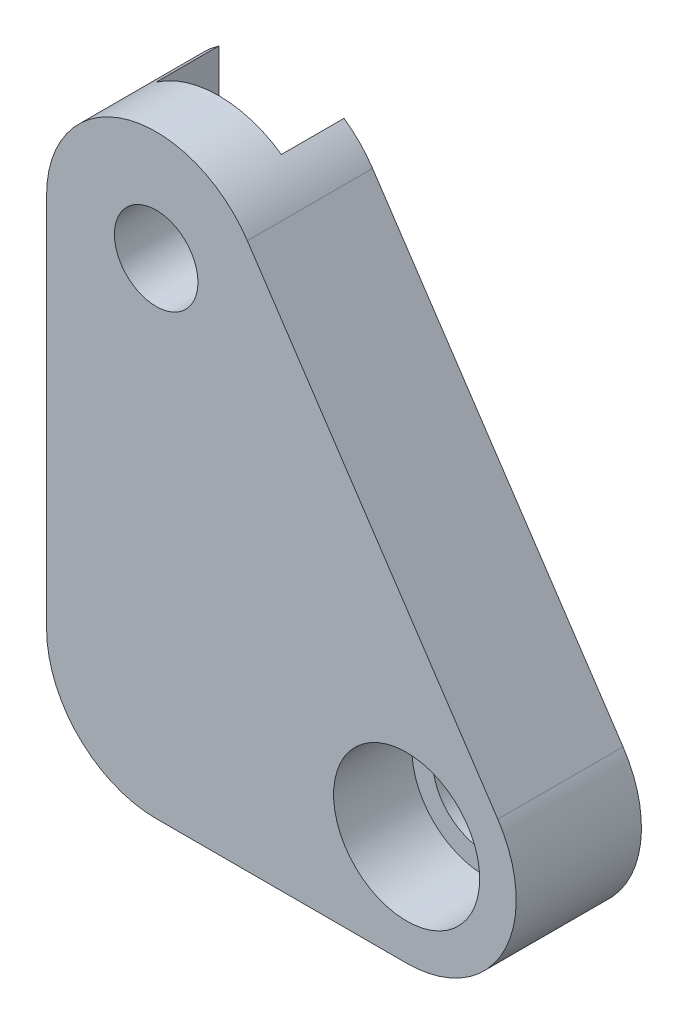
ISO-10303-21;
HEADER;
FILE_DESCRIPTION(('STEP AP214'),'2;1');
FILE_NAME('part.step','',(''),(''),'','','');
FILE_SCHEMA(('AUTOMOTIVE_DESIGN { 1 0 10303 214 1 1 1 1 }'));
ENDSEC;
DATA;
#1=APPLICATION_CONTEXT('core data for automotive mechanical design processes');
#2=APPLICATION_PROTOCOL_DEFINITION('international standard','automotive_design',2000,#1);
#3=PRODUCT_CONTEXT('',#1,'mechanical');
#4=PRODUCT('Part','Part','',(#3));
#5=PRODUCT_RELATED_PRODUCT_CATEGORY('part','',(#4));
#6=PRODUCT_DEFINITION_FORMATION('','',#4);
#7=PRODUCT_DEFINITION_CONTEXT('part definition',#1,'design');
#8=PRODUCT_DEFINITION('design','',#6,#7);
#9=PRODUCT_DEFINITION_SHAPE('','',#8);
#10=(LENGTH_UNIT() NAMED_UNIT(*) SI_UNIT(.MILLI.,.METRE.));
#11=(NAMED_UNIT(*) PLANE_ANGLE_UNIT() SI_UNIT($,.RADIAN.));
#12=(NAMED_UNIT(*) SI_UNIT($,.STERADIAN.) SOLID_ANGLE_UNIT());
#13=UNCERTAINTY_MEASURE_WITH_UNIT(LENGTH_MEASURE(1.E-05),#10,'distance_accuracy_value','');
#14=(GEOMETRIC_REPRESENTATION_CONTEXT(3) GLOBAL_UNCERTAINTY_ASSIGNED_CONTEXT((#13)) GLOBAL_UNIT_ASSIGNED_CONTEXT((#10,
#11,#12)) REPRESENTATION_CONTEXT('',''));
#15=CARTESIAN_POINT('',(0.,0.,0.));
#16=DIRECTION('',(0.,0.,1.));
#17=DIRECTION('',(1.,0.,0.));
#18=AXIS2_PLACEMENT_3D('',#15,#16,#17);
#19=CARTESIAN_POINT('',(1.94995117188,93.0009999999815,18.));
#20=DIRECTION('',(0.,0.,1.));
#21=DIRECTION('',(1.,0.,0.));
#22=AXIS2_PLACEMENT_3D('',#19,#20,#21);
#23=PLANE('',#22);
#24=DIRECTION('',(-1.,0.,0.));
#25=VECTOR('',#24,1.);
#26=CARTESIAN_POINT('',(1.94995117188,-21.,18.));
#27=LINE('',#26,#25);
#28=CARTESIAN_POINT('',(1.94995117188,-21.,18.));
#29=VERTEX_POINT('',#28);
#30=CARTESIAN_POINT('',(-10.0500488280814,-21.,18.));
#31=VERTEX_POINT('',#30);
#32=EDGE_CURVE('E121',#29,#31,#27,.T.);
#33=ORIENTED_EDGE('',*,*,#32,.T.);
#34=CARTESIAN_POINT('',(-10.0500488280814,1.70835567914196E-11,18.));
#35=DIRECTION('',(0.,0.,1.));
#36=DIRECTION('',(1.,0.,0.));
#37=AXIS2_PLACEMENT_3D('',#34,#35,#36);
#38=CIRCLE('',#37,21.);
#39=CARTESIAN_POINT('',(-22.0500488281,-17.2336879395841,18.));
#40=VERTEX_POINT('',#39);
#41=EDGE_CURVE('E173',#31,#40,#38,.F.);
#42=ORIENTED_EDGE('',*,*,#41,.T.);
#43=DIRECTION('',(0.,-1.,0.));
#44=VECTOR('',#43,1.);
#45=CARTESIAN_POINT('',(-22.0500488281,93.0009999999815,18.));
#46=LINE('',#45,#44);
#47=CARTESIAN_POINT('',(-22.0500488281,89.2336879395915,18.));
#48=VERTEX_POINT('',#47);
#49=EDGE_CURVE('E179',#48,#40,#46,.T.);
#50=ORIENTED_EDGE('',*,*,#49,.F.);
#51=CARTESIAN_POINT('',(-10.0500488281,72.,18.));
#52=DIRECTION('',(0.,0.,1.));
#53=DIRECTION('',(1.,0.,0.));
#54=AXIS2_PLACEMENT_3D('',#51,#52,#53);
#55=CIRCLE('',#54,20.9999999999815);
#56=CARTESIAN_POINT('',(1.94995117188,89.2336879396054,18.));
#57=VERTEX_POINT('',#56);
#58=EDGE_CURVE('E130',#57,#48,#55,.T.);
#59=ORIENTED_EDGE('',*,*,#58,.F.);
#60=DIRECTION('',(0.,-1.,0.));
#61=VECTOR('',#60,1.);
#62=CARTESIAN_POINT('',(1.94995117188,93.0009999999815,18.));
#63=LINE('',#62,#61);
#64=EDGE_CURVE('E184',#57,#29,#63,.T.);
#65=ORIENTED_EDGE('',*,*,#64,.T.);
#66=EDGE_LOOP('',(#33,#42,#50,#59,#65));
#67=FACE_BOUND('',#66,.T.);
#68=CARTESIAN_POINT('',(-10.0500488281,72.,18.));
#69=DIRECTION('',(0.,0.,-1.));
#70=DIRECTION('',(-1.,0.,0.));
#71=AXIS2_PLACEMENT_3D('',#68,#69,#70);
#72=CIRCLE('',#71,7.99999999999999);
#73=CARTESIAN_POINT('',(-18.0500488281,72.,18.));
#74=VERTEX_POINT('',#73);
#75=EDGE_CURVE('E219',#74,#74,#72,.T.);
#76=ORIENTED_EDGE('',*,*,#75,.F.);
#77=EDGE_LOOP('',(#76));
#78=FACE_BOUND('',#77,.T.);
#79=ADVANCED_FACE('F37',(#67,#78),#23,.F.);
#80=CARTESIAN_POINT('',(-10.0500488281,72.,6.));
#81=DIRECTION('',(0.,0.,-1.));
#82=DIRECTION('',(-1.,0.,0.));
#83=AXIS2_PLACEMENT_3D('',#80,#81,#82);
#84=PLANE('',#83);
#85=DIRECTION('',(0.,-1.,0.));
#86=VECTOR('',#85,1.);
#87=CARTESIAN_POINT('',(-22.0500488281,93.0009999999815,6.));
#88=LINE('',#87,#86);
#89=CARTESIAN_POINT('',(-22.0500488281,89.2336879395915,6.));
#90=VERTEX_POINT('',#89);
#91=CARTESIAN_POINT('',(-22.0500488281,-17.2336879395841,6.));
#92=VERTEX_POINT('',#91);
#93=EDGE_CURVE('E111',#90,#92,#88,.T.);
#94=ORIENTED_EDGE('',*,*,#93,.T.);
#95=CARTESIAN_POINT('',(-10.0500488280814,1.70835567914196E-11,6.));
#96=DIRECTION('',(0.,0.,-1.));
#97=DIRECTION('',(-1.,0.,0.));
#98=AXIS2_PLACEMENT_3D('',#95,#96,#97);
#99=CIRCLE('',#98,21.);
#100=CARTESIAN_POINT('',(-31.0500488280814,1.70766178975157E-11,6.));
#101=VERTEX_POINT('',#100);
#102=EDGE_CURVE('E59',#92,#101,#99,.T.);
#103=ORIENTED_EDGE('',*,*,#102,.T.);
#104=DIRECTION('',(0.,1.,0.));
#105=VECTOR('',#104,1.);
#106=CARTESIAN_POINT('',(-31.0500488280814,-20.9999999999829,6.));
#107=LINE('',#106,#105);
#108=CARTESIAN_POINT('',(-31.0500488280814,72.,6.));
#109=VERTEX_POINT('',#108);
#110=EDGE_CURVE('E134',#101,#109,#107,.T.);
#111=ORIENTED_EDGE('',*,*,#110,.T.);
#112=CARTESIAN_POINT('',(-10.0500488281,72.,6.));
#113=DIRECTION('',(0.,0.,-1.));
#114=DIRECTION('',(-1.,0.,0.));
#115=AXIS2_PLACEMENT_3D('',#112,#113,#114);
#116=CIRCLE('',#115,20.9999999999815);
#117=EDGE_CURVE('E128',#109,#90,#116,.T.);
#118=ORIENTED_EDGE('',*,*,#117,.T.);
#119=EDGE_LOOP('',(#94,#103,#111,#118));
#120=FACE_BOUND('',#119,.T.);
#121=ADVANCED_FACE('F133',(#120),#84,.T.);
#122=CARTESIAN_POINT('',(37.9499511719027,-20.9999999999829,30.));
#123=DIRECTION('',(0.,-1.,0.));
#124=DIRECTION('',(0.,0.,-1.));
#125=AXIS2_PLACEMENT_3D('',#122,#123,#124);
#126=PLANE('',#125);
#127=DIRECTION('',(-1.,0.,0.));
#128=VECTOR('',#127,1.);
#129=CARTESIAN_POINT('',(37.9499511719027,-20.9999999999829,30.));
#130=LINE('',#129,#128);
#131=CARTESIAN_POINT('',(37.9499511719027,-20.9999999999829,30.));
#132=VERTEX_POINT('',#131);
#133=CARTESIAN_POINT('',(-10.0500488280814,-20.9999999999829,30.));
#134=VERTEX_POINT('',#133);
#135=EDGE_CURVE('E147',#132,#134,#130,.T.);
#136=ORIENTED_EDGE('',*,*,#135,.T.);
#137=DIRECTION('',(0.,0.,-1.));
#138=VECTOR('',#137,1.);
#139=CARTESIAN_POINT('',(-10.0500488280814,-20.9999999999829,30.));
#140=LINE('',#139,#138);
#141=EDGE_CURVE('E164',#134,#31,#140,.T.);
#142=ORIENTED_EDGE('',*,*,#141,.T.);
#143=ORIENTED_EDGE('',*,*,#32,.F.);
#144=DIRECTION('',(0.,0.,1.));
#145=VECTOR('',#144,1.);
#146=CARTESIAN_POINT('',(1.94995117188,-21.,6.));
#147=LINE('',#146,#145);
#148=CARTESIAN_POINT('',(1.94995117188,-21.,6.));
#149=VERTEX_POINT('',#148);
#150=EDGE_CURVE('E131',#149,#29,#147,.T.);
#151=ORIENTED_EDGE('',*,*,#150,.F.);
#152=DIRECTION('',(-1.,0.,0.));
#153=VECTOR('',#152,1.);
#154=CARTESIAN_POINT('',(37.9499511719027,-20.9999999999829,6.));
#155=LINE('',#154,#153);
#156=CARTESIAN_POINT('',(37.9499511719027,-20.9999999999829,6.));
#157=VERTEX_POINT('',#156);
#158=EDGE_CURVE('E183',#157,#149,#155,.T.);
#159=ORIENTED_EDGE('',*,*,#158,.F.);
#160=DIRECTION('',(0.,0.,-1.));
#161=VECTOR('',#160,1.);
#162=CARTESIAN_POINT('',(37.9499511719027,-20.9999999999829,30.));
#163=LINE('',#162,#161);
#164=EDGE_CURVE('E162',#132,#157,#163,.T.);
#165=ORIENTED_EDGE('',*,*,#164,.F.);
#166=EDGE_LOOP('',(#136,#142,#143,#151,#159,#165));
#167=FACE_BOUND('',#166,.T.);
#168=ADVANCED_FACE('F39',(#167),#126,.T.);
#169=CARTESIAN_POINT('',(37.9499511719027,1.81278603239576E-12,30.));
#170=DIRECTION('',(0.,0.,-1.));
#171=DIRECTION('',(-1.,0.,0.));
#172=AXIS2_PLACEMENT_3D('',#169,#170,#171);
#173=CYLINDRICAL_SURFACE('',#172,20.9999999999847);
#174=CARTESIAN_POINT('',(37.9499511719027,1.81278603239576E-12,6.));
#175=DIRECTION('',(0.,0.,-1.));
#176=DIRECTION('',(-1.,0.,0.));
#177=AXIS2_PLACEMENT_3D('',#174,#175,#176);
#178=CIRCLE('',#177,20.9999999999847);
#179=CARTESIAN_POINT('',(55.4230073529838,11.6487041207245,6.));
#180=VERTEX_POINT('',#179);
#181=EDGE_CURVE('E140',#180,#157,#178,.T.);
#182=ORIENTED_EDGE('',*,*,#181,.F.);
#183=DIRECTION('',(0.,0.,-1.));
#184=VECTOR('',#183,1.);
#185=CARTESIAN_POINT('',(55.4230073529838,11.6487041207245,30.));
#186=LINE('',#185,#184);
#187=CARTESIAN_POINT('',(55.4230073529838,11.6487041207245,30.));
#188=VERTEX_POINT('',#187);
#189=EDGE_CURVE('E165',#188,#180,#186,.T.);
#190=ORIENTED_EDGE('',*,*,#189,.F.);
#191=CARTESIAN_POINT('',(37.9499511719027,1.81278603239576E-12,30.));
#192=DIRECTION('',(0.,0.,-1.));
#193=DIRECTION('',(-1.,0.,0.));
#194=AXIS2_PLACEMENT_3D('',#191,#192,#193);
#195=CIRCLE('',#194,20.9999999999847);
#196=EDGE_CURVE('E158',#188,#132,#195,.T.);
#197=ORIENTED_EDGE('',*,*,#196,.T.);
#198=ORIENTED_EDGE('',*,*,#164,.T.);
#199=EDGE_LOOP('',(#182,#190,#197,#198));
#200=FACE_BOUND('',#199,.T.);
#201=ADVANCED_FACE('F199',(#200),#173,.T.);
#202=CARTESIAN_POINT('',(7.4230073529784,83.6487041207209,30.));
#203=DIRECTION('',(0.832050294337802,0.554700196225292,0.));
#204=DIRECTION('',(-0.554700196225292,0.832050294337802,0.));
#205=AXIS2_PLACEMENT_3D('',#202,#203,#204);
#206=PLANE('',#205);
#207=DIRECTION('',(0.554700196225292,-0.832050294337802,0.));
#208=VECTOR('',#207,1.);
#209=CARTESIAN_POINT('',(7.4230073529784,83.6487041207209,6.));
#210=LINE('',#209,#208);
#211=CARTESIAN_POINT('',(7.4230073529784,83.6487041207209,6.));
#212=VERTEX_POINT('',#211);
#213=EDGE_CURVE('E136',#212,#180,#210,.T.);
#214=ORIENTED_EDGE('',*,*,#213,.F.);
#215=DIRECTION('',(0.,0.,-1.));
#216=VECTOR('',#215,1.);
#217=CARTESIAN_POINT('',(7.4230073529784,83.6487041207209,30.));
#218=LINE('',#217,#216);
#219=CARTESIAN_POINT('',(7.4230073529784,83.6487041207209,30.));
#220=VERTEX_POINT('',#219);
#221=EDGE_CURVE('E167',#220,#212,#218,.T.);
#222=ORIENTED_EDGE('',*,*,#221,.F.);
#223=DIRECTION('',(0.554700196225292,-0.832050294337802,0.));
#224=VECTOR('',#223,1.);
#225=CARTESIAN_POINT('',(7.4230073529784,83.6487041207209,30.));
#226=LINE('',#225,#224);
#227=EDGE_CURVE('E155',#220,#188,#226,.T.);
#228=ORIENTED_EDGE('',*,*,#227,.T.);
#229=ORIENTED_EDGE('',*,*,#189,.T.);
#230=EDGE_LOOP('',(#214,#222,#228,#229));
#231=FACE_BOUND('',#230,.T.);
#232=ADVANCED_FACE('F267',(#231),#206,.T.);
#233=CARTESIAN_POINT('',(-10.0500488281,72.,30.));
#234=DIRECTION('',(0.,0.,-1.));
#235=DIRECTION('',(-1.,0.,0.));
#236=AXIS2_PLACEMENT_3D('',#233,#234,#235);
#237=CYLINDRICAL_SURFACE('',#236,20.9999999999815);
#238=DIRECTION('',(0.,0.,-1.));
#239=VECTOR('',#238,1.);
#240=CARTESIAN_POINT('',(-22.0500488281,89.2336879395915,30.));
#241=LINE('',#240,#239);
#242=EDGE_CURVE('E115',#48,#90,#241,.T.);
#243=ORIENTED_EDGE('',*,*,#242,.T.);
#244=ORIENTED_EDGE('',*,*,#117,.F.);
#245=DIRECTION('',(0.,0.,-1.));
#246=VECTOR('',#245,1.);
#247=CARTESIAN_POINT('',(-31.0500488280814,72.,30.));
#248=LINE('',#247,#246);
#249=CARTESIAN_POINT('',(-31.0500488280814,72.,30.));
#250=VERTEX_POINT('',#249);
#251=EDGE_CURVE('E161',#250,#109,#248,.T.);
#252=ORIENTED_EDGE('',*,*,#251,.F.);
#253=CARTESIAN_POINT('',(-10.0500488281,72.,30.));
#254=DIRECTION('',(0.,0.,-1.));
#255=DIRECTION('',(-1.,0.,0.));
#256=AXIS2_PLACEMENT_3D('',#253,#254,#255);
#257=CIRCLE('',#256,20.9999999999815);
#258=EDGE_CURVE('E152',#250,#220,#257,.T.);
#259=ORIENTED_EDGE('',*,*,#258,.T.);
#260=ORIENTED_EDGE('',*,*,#221,.T.);
#261=CARTESIAN_POINT('',(1.94995117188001,89.2336879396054,6.));
#262=VERTEX_POINT('',#261);
#263=EDGE_CURVE('E137',#262,#212,#116,.T.);
#264=ORIENTED_EDGE('',*,*,#263,.F.);
#265=DIRECTION('',(0.,0.,-1.));
#266=VECTOR('',#265,1.);
#267=CARTESIAN_POINT('',(1.94995117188,89.2336879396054,30.));
#268=LINE('',#267,#266);
#269=EDGE_CURVE('E214',#262,#57,#268,.F.);
#270=ORIENTED_EDGE('',*,*,#269,.T.);
#271=ORIENTED_EDGE('',*,*,#58,.T.);
#272=EDGE_LOOP('',(#243,#244,#252,#259,#260,#264,#270,#271));
#273=FACE_BOUND('',#272,.T.);
#274=ADVANCED_FACE('F126',(#273),#237,.T.);
#275=CARTESIAN_POINT('',(-31.0500488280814,-20.9999999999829,30.));
#276=DIRECTION('',(-1.,0.,0.));
#277=DIRECTION('',(0.,0.,1.));
#278=AXIS2_PLACEMENT_3D('',#275,#276,#277);
#279=PLANE('',#278);
#280=ORIENTED_EDGE('',*,*,#110,.F.);
#281=DIRECTION('',(0.,0.,-1.));
#282=VECTOR('',#281,1.);
#283=CARTESIAN_POINT('',(-31.0500488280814,1.70835567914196E-11,30.));
#284=LINE('',#283,#282);
#285=CARTESIAN_POINT('',(-31.0500488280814,1.70766178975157E-11,30.));
#286=VERTEX_POINT('',#285);
#287=EDGE_CURVE('E45',#101,#286,#284,.F.);
#288=ORIENTED_EDGE('',*,*,#287,.T.);
#289=DIRECTION('',(0.,1.,0.));
#290=VECTOR('',#289,1.);
#291=CARTESIAN_POINT('',(-31.0500488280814,-20.9999999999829,30.));
#292=LINE('',#291,#290);
#293=EDGE_CURVE('E150',#286,#250,#292,.T.);
#294=ORIENTED_EDGE('',*,*,#293,.T.);
#295=ORIENTED_EDGE('',*,*,#251,.T.);
#296=EDGE_LOOP('',(#280,#288,#294,#295));
#297=FACE_BOUND('',#296,.T.);
#298=ADVANCED_FACE('F204',(#297),#279,.T.);
#299=CARTESIAN_POINT('',(-10.0500488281,72.,30.));
#300=DIRECTION('',(0.,0.,-1.));
#301=DIRECTION('',(-1.,0.,0.));
#302=AXIS2_PLACEMENT_3D('',#299,#300,#301);
#303=PLANE('',#302);
#304=CARTESIAN_POINT('',(37.9499511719,0.,30.));
#305=DIRECTION('',(0.,0.,1.));
#306=DIRECTION('',(1.,0.,0.));
#307=AXIS2_PLACEMENT_3D('',#304,#305,#306);
#308=CIRCLE('',#307,14.);
#309=CARTESIAN_POINT('',(51.9499511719,0.,30.));
#310=VERTEX_POINT('',#309);
#311=EDGE_CURVE('E231',#310,#310,#308,.T.);
#312=ORIENTED_EDGE('',*,*,#311,.F.);
#313=EDGE_LOOP('',(#312));
#314=FACE_BOUND('',#313,.T.);
#315=CARTESIAN_POINT('',(-10.0500488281,72.,30.));
#316=DIRECTION('',(0.,0.,-1.));
#317=DIRECTION('',(-1.,0.,0.));
#318=AXIS2_PLACEMENT_3D('',#315,#316,#317);
#319=CIRCLE('',#318,7.99999999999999);
#320=CARTESIAN_POINT('',(-18.0500488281,72.,30.));
#321=VERTEX_POINT('',#320);
#322=EDGE_CURVE('E216',#321,#321,#319,.T.);
#323=ORIENTED_EDGE('',*,*,#322,.T.);
#324=EDGE_LOOP('',(#323));
#325=FACE_BOUND('',#324,.T.);
#326=ORIENTED_EDGE('',*,*,#293,.F.);
#327=CARTESIAN_POINT('',(-10.0500488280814,1.70835567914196E-11,30.));
#328=DIRECTION('',(0.,0.,-1.));
#329=DIRECTION('',(-1.,0.,0.));
#330=AXIS2_PLACEMENT_3D('',#327,#328,#329);
#331=CIRCLE('',#330,21.);
#332=EDGE_CURVE('E11',#286,#134,#331,.F.);
#333=ORIENTED_EDGE('',*,*,#332,.T.);
#334=ORIENTED_EDGE('',*,*,#135,.F.);
#335=ORIENTED_EDGE('',*,*,#196,.F.);
#336=ORIENTED_EDGE('',*,*,#227,.F.);
#337=ORIENTED_EDGE('',*,*,#258,.F.);
#338=EDGE_LOOP('',(#326,#333,#334,#335,#336,#337));
#339=FACE_BOUND('',#338,.T.);
#340=ADVANCED_FACE('F190',(#314,#325,#339),#303,.F.);
#341=CARTESIAN_POINT('',(37.9499511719,0.,6.));
#342=DIRECTION('',(0.,0.,-1.));
#343=DIRECTION('',(-1.,0.,0.));
#344=AXIS2_PLACEMENT_3D('',#341,#342,#343);
#345=CIRCLE('',#344,10.);
#346=CARTESIAN_POINT('',(27.9499511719,0.,6.));
#347=VERTEX_POINT('',#346);
#348=EDGE_CURVE('E222',#347,#347,#345,.T.);
#349=ORIENTED_EDGE('',*,*,#348,.F.);
#350=EDGE_LOOP('',(#349));
#351=FACE_BOUND('',#350,.T.);
#352=DIRECTION('',(0.,-1.,0.));
#353=VECTOR('',#352,1.);
#354=CARTESIAN_POINT('',(1.94995117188,93.0009999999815,6.));
#355=LINE('',#354,#353);
#356=EDGE_CURVE('E120',#262,#149,#355,.T.);
#357=ORIENTED_EDGE('',*,*,#356,.F.);
#358=ORIENTED_EDGE('',*,*,#263,.T.);
#359=ORIENTED_EDGE('',*,*,#213,.T.);
#360=ORIENTED_EDGE('',*,*,#181,.T.);
#361=ORIENTED_EDGE('',*,*,#158,.T.);
#362=EDGE_LOOP('',(#357,#358,#359,#360,#361));
#363=FACE_BOUND('',#362,.T.);
#364=ADVANCED_FACE('F239',(#351,#363),#84,.T.);
#365=CARTESIAN_POINT('',(-22.0500488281,93.0009999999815,18.));
#366=DIRECTION('',(-1.,0.,0.));
#367=DIRECTION('',(0.,0.,1.));
#368=AXIS2_PLACEMENT_3D('',#365,#366,#367);
#369=PLANE('',#368);
#370=ORIENTED_EDGE('',*,*,#49,.T.);
#371=DIRECTION('',(0.,0.,-1.));
#372=VECTOR('',#371,1.);
#373=CARTESIAN_POINT('',(-22.0500488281,-17.2336879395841,18.));
#374=LINE('',#373,#372);
#375=EDGE_CURVE('E118',#40,#92,#374,.T.);
#376=ORIENTED_EDGE('',*,*,#375,.T.);
#377=ORIENTED_EDGE('',*,*,#93,.F.);
#378=ORIENTED_EDGE('',*,*,#242,.F.);
#379=EDGE_LOOP('',(#370,#376,#377,#378));
#380=FACE_BOUND('',#379,.T.);
#381=ADVANCED_FACE('F114',(#380),#369,.F.);
#382=CARTESIAN_POINT('',(1.94995117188,93.0009999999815,6.));
#383=DIRECTION('',(1.,0.,0.));
#384=DIRECTION('',(0.,0.,-1.));
#385=AXIS2_PLACEMENT_3D('',#382,#383,#384);
#386=PLANE('',#385);
#387=ORIENTED_EDGE('',*,*,#356,.T.);
#388=ORIENTED_EDGE('',*,*,#150,.T.);
#389=ORIENTED_EDGE('',*,*,#64,.F.);
#390=ORIENTED_EDGE('',*,*,#269,.F.);
#391=EDGE_LOOP('',(#387,#388,#389,#390));
#392=FACE_BOUND('',#391,.T.);
#393=ADVANCED_FACE('F247',(#392),#386,.F.);
#394=CARTESIAN_POINT('',(-10.0500488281,72.,18.));
#395=DIRECTION('',(0.,0.,-1.));
#396=DIRECTION('',(-1.,0.,0.));
#397=AXIS2_PLACEMENT_3D('',#394,#395,#396);
#398=CYLINDRICAL_SURFACE('',#397,7.99999999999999);
#399=ORIENTED_EDGE('',*,*,#322,.F.);
#400=EDGE_LOOP('',(#399));
#401=FACE_BOUND('',#400,.T.);
#402=ORIENTED_EDGE('',*,*,#75,.T.);
#403=EDGE_LOOP('',(#402));
#404=FACE_BOUND('',#403,.T.);
#405=ADVANCED_FACE('F243',(#401,#404),#398,.F.);
#406=CARTESIAN_POINT('',(37.9499511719,0.,30.));
#407=DIRECTION('',(0.,0.,1.));
#408=DIRECTION('',(1.,0.,0.));
#409=AXIS2_PLACEMENT_3D('',#406,#407,#408);
#410=CYLINDRICAL_SURFACE('',#409,10.);
#411=CARTESIAN_POINT('',(37.9499511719,0.,15.));
#412=DIRECTION('',(0.,0.,1.));
#413=DIRECTION('',(1.,0.,0.));
#414=AXIS2_PLACEMENT_3D('',#411,#412,#413);
#415=CIRCLE('',#414,10.);
#416=CARTESIAN_POINT('',(47.9499511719,0.,15.));
#417=VERTEX_POINT('',#416);
#418=EDGE_CURVE('E225',#417,#417,#415,.T.);
#419=ORIENTED_EDGE('',*,*,#418,.T.);
#420=EDGE_LOOP('',(#419));
#421=FACE_BOUND('',#420,.T.);
#422=ORIENTED_EDGE('',*,*,#348,.T.);
#423=EDGE_LOOP('',(#422));
#424=FACE_BOUND('',#423,.T.);
#425=ADVANCED_FACE('F246',(#421,#424),#410,.F.);
#426=CARTESIAN_POINT('',(47.9499511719,0.,15.));
#427=DIRECTION('',(0.,0.,-1.));
#428=DIRECTION('',(-1.,0.,0.));
#429=AXIS2_PLACEMENT_3D('',#426,#427,#428);
#430=PLANE('',#429);
#431=ORIENTED_EDGE('',*,*,#418,.F.);
#432=EDGE_LOOP('',(#431));
#433=FACE_BOUND('',#432,.T.);
#434=CARTESIAN_POINT('',(37.9499511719,0.,15.));
#435=DIRECTION('',(0.,0.,1.));
#436=DIRECTION('',(1.,0.,0.));
#437=AXIS2_PLACEMENT_3D('',#434,#435,#436);
#438=CIRCLE('',#437,14.);
#439=CARTESIAN_POINT('',(51.9499511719,0.,15.));
#440=VERTEX_POINT('',#439);
#441=EDGE_CURVE('E228',#440,#440,#438,.T.);
#442=ORIENTED_EDGE('',*,*,#441,.T.);
#443=EDGE_LOOP('',(#442));
#444=FACE_BOUND('',#443,.T.);
#445=ADVANCED_FACE('F304',(#433,#444),#430,.F.);
#446=CARTESIAN_POINT('',(37.9499511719,0.,30.));
#447=DIRECTION('',(0.,0.,1.));
#448=DIRECTION('',(1.,0.,0.));
#449=AXIS2_PLACEMENT_3D('',#446,#447,#448);
#450=CYLINDRICAL_SURFACE('',#449,14.);
#451=ORIENTED_EDGE('',*,*,#441,.F.);
#452=EDGE_LOOP('',(#451));
#453=FACE_BOUND('',#452,.T.);
#454=ORIENTED_EDGE('',*,*,#311,.T.);
#455=EDGE_LOOP('',(#454));
#456=FACE_BOUND('',#455,.T.);
#457=ADVANCED_FACE('F235',(#453,#456),#450,.F.);
#458=CARTESIAN_POINT('',(-10.0500488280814,1.70835567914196E-11,30.));
#459=DIRECTION('',(0.,0.,-1.));
#460=DIRECTION('',(-1.,0.,0.));
#461=AXIS2_PLACEMENT_3D('',#458,#459,#460);
#462=CYLINDRICAL_SURFACE('',#461,21.);
#463=ORIENTED_EDGE('',*,*,#332,.F.);
#464=ORIENTED_EDGE('',*,*,#287,.F.);
#465=ORIENTED_EDGE('',*,*,#102,.F.);
#466=ORIENTED_EDGE('',*,*,#375,.F.);
#467=ORIENTED_EDGE('',*,*,#41,.F.);
#468=ORIENTED_EDGE('',*,*,#141,.F.);
#469=EDGE_LOOP('',(#463,#464,#465,#466,#467,#468));
#470=FACE_BOUND('',#469,.T.);
#471=ADVANCED_FACE('F187',(#470),#462,.T.);
#472=CLOSED_SHELL('',(#79,#121,#168,#201,#232,#274,#298,#340,#364,#381,#393,#405,#425,#445,#457,#471));
#473=MANIFOLD_SOLID_BREP('B2',#472);
#474=ADVANCED_BREP_SHAPE_REPRESENTATION('',(#18,#473),#14);
#475=SHAPE_DEFINITION_REPRESENTATION(#9,#474);
ENDSEC;
END-ISO-10303-21;
